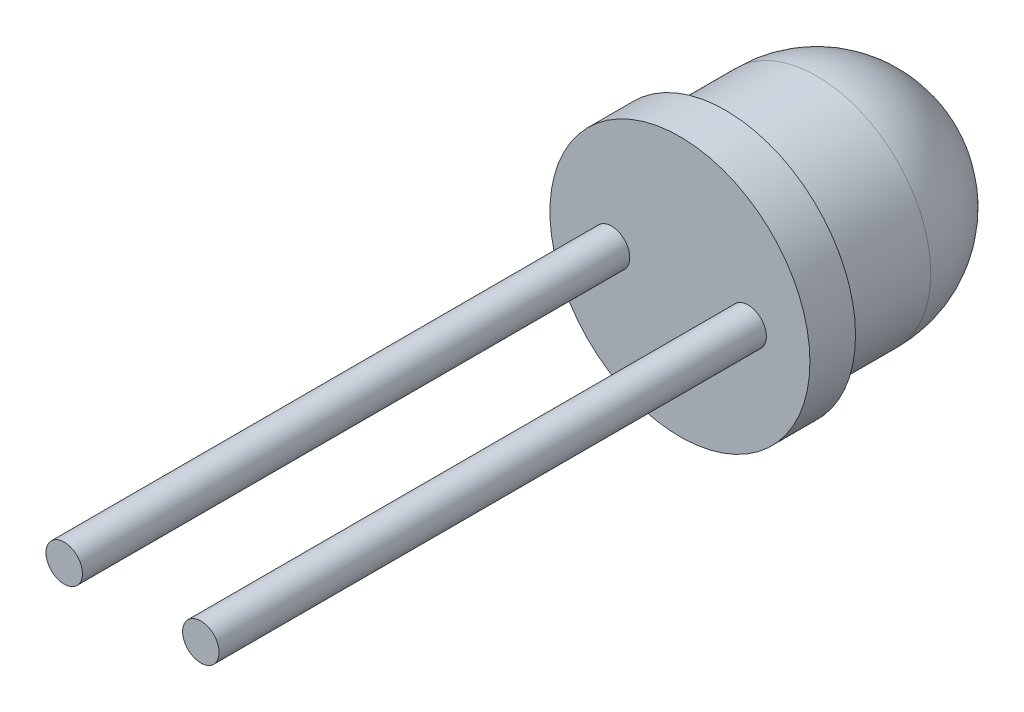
from build123d import *

# Parameters (mm, degrees)
ESQUISSE3_R          = 2.5
BASE_EXTRUSION_DEPTH = 5.5
CONG_3_R             = 2.5
ESQUISSE4_R          = 2.85
BOSS_EXTRU_1_DEPTH   = 1
ESQUISSE5_R          = 0.4
BOSS_EXTRU_2_DEPTH   = 12


with BuildPart() as part:
    # Esquisse3 → Base-Extrusion (new body)
    with BuildSketch(Plane.XY):
        with Locations(Location((0, 0, 0), (0, 0, 180))):
            Circle(ESQUISSE3_R)
    extrude(amount=BASE_EXTRUSION_DEPTH)

    # Cong_3
    cong_3_edges = [part.edges().sort_by_distance(p)[0] for p in [
        (2.5, 0, 0),
    ]]
    fillet(cong_3_edges, radius=CONG_3_R)

    # Esquisse4 → Boss.-Extru.1 (add)
    with BuildSketch(Plane.XY.offset(5.5)):
        Circle(ESQUISSE4_R)
    extrude(amount=-BOSS_EXTRU_1_DEPTH)

    # Esquisse5 → Boss.-Extru.2 (add)
    with BuildSketch(Plane.XY.offset(5.5)):
        with Locations((-1.5, 0)):
            Circle(ESQUISSE5_R)
        with Locations((1.495230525, 0)):
            Circle(ESQUISSE5_R)
    extrude(amount=BOSS_EXTRU_2_DEPTH)


solid = part.part
